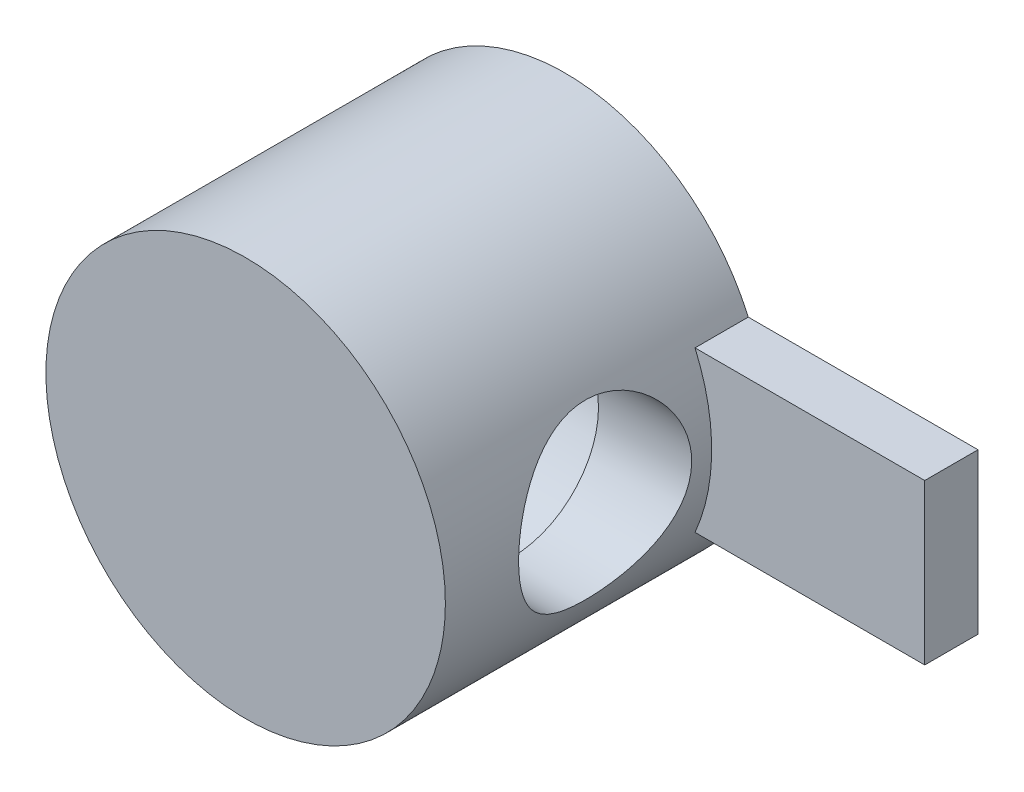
from build123d import *

# Parameters (mm, degrees)
SKETCH_1_R          = 7.5
EXTRUDE_1_DEPTH     = 6
EXTRUDE_START       = -2
EXTRUDE_2_DEPTH     = 2
SKETCH_3_R          = 3.25
CUT_EXTRUDE_1_DEPTH = 10
SKETCH_4_R          = 5
CUT_EXTRUDE_2_DEPTH = 20
CUT_EXTRUDE_START   = 4
SKETCH_5_R          = 5
CUT_EXTRUDE_3_DEPTH = 4


with BuildPart() as part:
    # Sketch 1 → Extrude 1 (new, symmetric)
    with BuildSketch(Plane.XY):
        Circle(SKETCH_1_R)
    extrude(amount=EXTRUDE_1_DEPTH, both=True)

    # Sketch 2 → Extrude 2 (add)
    with BuildSketch(Plane(origin=(0, 0, -6), x_dir=(-1, 0, 0), z_dir=(0, 0, -1)).offset(EXTRUDE_START)):
        with BuildLine():
            Line((-6.873863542, 3), (-15.5, 3))
            Line((-15.5, 3), (-15.5, -3))
            Line((-15.5, -3), (-6.873863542, -3))
            ThreePointArc((-6.873863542, -3), (-7.5, 0), (-6.873863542, 3))
        make_face()
    extrude(amount=EXTRUDE_2_DEPTH)

    # Sketch 3 → Cut-Extrude 1 (cut, symmetric)
    with BuildSketch(Plane(origin=(0, 0, 0), x_dir=(0, 0, -1), z_dir=(1, 0, 0))):
        Circle(SKETCH_3_R)
    extrude(amount=CUT_EXTRUDE_1_DEPTH, both=True, mode=Mode.SUBTRACT)

    # Sketch 4 → Cut-Extrude 2 (cut)
    with BuildSketch(Plane(origin=(0, 0, 0), x_dir=(0, 0, -1), z_dir=(1, 0, 0))):
        Circle(SKETCH_4_R)
    extrude(amount=-CUT_EXTRUDE_2_DEPTH, mode=Mode.SUBTRACT)

    # Sketch 5 → Cut-Extrude 3 (cut)
    with BuildSketch(Plane(origin=(0, 0, 0), x_dir=(0, 0, -1), z_dir=(1, 0, 0)).offset(CUT_EXTRUDE_START)):
        Circle(SKETCH_5_R)
    extrude(amount=-CUT_EXTRUDE_3_DEPTH, mode=Mode.SUBTRACT)


solid = part.part
